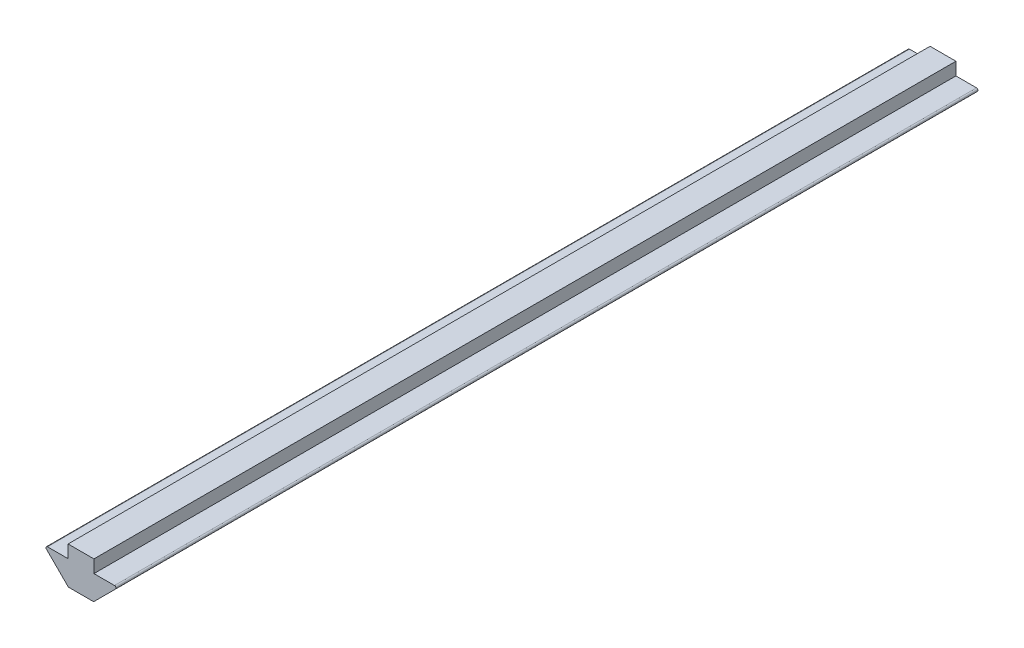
ISO-10303-21;
HEADER;
FILE_DESCRIPTION(('STEP AP214'),'2;1');
FILE_NAME('part.step','',(''),(''),'','','');
FILE_SCHEMA(('AUTOMOTIVE_DESIGN { 1 0 10303 214 1 1 1 1 }'));
ENDSEC;
DATA;
#1=APPLICATION_CONTEXT('core data for automotive mechanical design processes');
#2=APPLICATION_PROTOCOL_DEFINITION('international standard','automotive_design',2000,#1);
#3=PRODUCT_CONTEXT('',#1,'mechanical');
#4=PRODUCT('Part','Part','',(#3));
#5=PRODUCT_RELATED_PRODUCT_CATEGORY('part','',(#4));
#6=PRODUCT_DEFINITION_FORMATION('','',#4);
#7=PRODUCT_DEFINITION_CONTEXT('part definition',#1,'design');
#8=PRODUCT_DEFINITION('design','',#6,#7);
#9=PRODUCT_DEFINITION_SHAPE('','',#8);
#10=(LENGTH_UNIT() NAMED_UNIT(*) SI_UNIT(.MILLI.,.METRE.));
#11=(NAMED_UNIT(*) PLANE_ANGLE_UNIT() SI_UNIT($,.RADIAN.));
#12=(NAMED_UNIT(*) SI_UNIT($,.STERADIAN.) SOLID_ANGLE_UNIT());
#13=UNCERTAINTY_MEASURE_WITH_UNIT(LENGTH_MEASURE(1.E-05),#10,'distance_accuracy_value','');
#14=(GEOMETRIC_REPRESENTATION_CONTEXT(3) GLOBAL_UNCERTAINTY_ASSIGNED_CONTEXT((#13)) GLOBAL_UNIT_ASSIGNED_CONTEXT((#10,
#11,#12)) REPRESENTATION_CONTEXT('',''));
#15=CARTESIAN_POINT('',(0.,0.,0.));
#16=DIRECTION('',(0.,0.,1.));
#17=DIRECTION('',(1.,0.,0.));
#18=AXIS2_PLACEMENT_3D('',#15,#16,#17);
#19=CARTESIAN_POINT('',(-1.5993719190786E-13,8.73933982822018,-171.700000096));
#20=DIRECTION('',(0.,1.,0.));
#21=DIRECTION('',(-1.,0.,0.));
#22=AXIS2_PLACEMENT_3D('',#19,#20,#21);
#23=PLANE('',#22);
#24=DIRECTION('',(-1.,0.,0.));
#25=VECTOR('',#24,1.);
#26=CARTESIAN_POINT('',(-1.5993719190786E-13,8.73933982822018,-171.700000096));
#27=LINE('',#26,#25);
#28=CARTESIAN_POINT('',(6.67157287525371,8.7393398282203,-171.700000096));
#29=VERTEX_POINT('',#28);
#30=CARTESIAN_POINT('',(2.57499999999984,8.73933982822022,-171.700000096));
#31=VERTEX_POINT('',#30);
#32=EDGE_CURVE('E135',#29,#31,#27,.T.);
#33=ORIENTED_EDGE('',*,*,#32,.T.);
#34=DIRECTION('',(0.,0.,-1.));
#35=VECTOR('',#34,1.);
#36=CARTESIAN_POINT('',(2.57499999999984,8.73933982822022,0.));
#37=LINE('',#36,#35);
#38=CARTESIAN_POINT('',(2.57499999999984,8.73933982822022,0.));
#39=VERTEX_POINT('',#38);
#40=EDGE_CURVE('E183',#39,#31,#37,.T.);
#41=ORIENTED_EDGE('',*,*,#40,.F.);
#42=DIRECTION('',(-1.,0.,0.));
#43=VECTOR('',#42,1.);
#44=CARTESIAN_POINT('',(-1.5993719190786E-13,8.73933982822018,0.));
#45=LINE('',#44,#43);
#46=CARTESIAN_POINT('',(6.67157287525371,8.7393398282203,0.));
#47=VERTEX_POINT('',#46);
#48=EDGE_CURVE('E151',#47,#39,#45,.T.);
#49=ORIENTED_EDGE('',*,*,#48,.F.);
#50=DIRECTION('',(0.,0.,1.));
#51=VECTOR('',#50,1.);
#52=CARTESIAN_POINT('',(6.67157287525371,8.7393398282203,-171.700000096));
#53=LINE('',#52,#51);
#54=EDGE_CURVE('E161',#29,#47,#53,.T.);
#55=ORIENTED_EDGE('',*,*,#54,.F.);
#56=EDGE_LOOP('',(#33,#41,#49,#55));
#57=FACE_BOUND('',#56,.T.);
#58=ADVANCED_FACE('F41',(#57),#23,.T.);
#59=CARTESIAN_POINT('',(-0.671751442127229,0.67175144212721,-171.700000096));
#60=DIRECTION('',(0.707106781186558,-0.707106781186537,0.));
#61=DIRECTION('',(0.707106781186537,0.707106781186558,0.));
#62=AXIS2_PLACEMENT_3D('',#59,#60,#61);
#63=PLANE('',#62);
#64=DIRECTION('',(0.707106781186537,0.707106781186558,0.));
#65=VECTOR('',#64,1.);
#66=CARTESIAN_POINT('',(-0.671751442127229,0.67175144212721,0.));
#67=LINE('',#66,#65);
#68=CARTESIAN_POINT('',(2.51649711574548,3.86000000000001,0.));
#69=VERTEX_POINT('',#68);
#70=CARTESIAN_POINT('',(6.88370490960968,8.22720779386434,0.));
#71=VERTEX_POINT('',#70);
#72=EDGE_CURVE('E143',#69,#71,#67,.T.);
#73=ORIENTED_EDGE('',*,*,#72,.F.);
#74=DIRECTION('',(0.,0.,1.));
#75=VECTOR('',#74,1.);
#76=CARTESIAN_POINT('',(2.51649711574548,3.86000000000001,-171.700000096));
#77=LINE('',#76,#75);
#78=CARTESIAN_POINT('',(2.51649711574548,3.86000000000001,-171.700000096));
#79=VERTEX_POINT('',#78);
#80=EDGE_CURVE('E11',#79,#69,#77,.T.);
#81=ORIENTED_EDGE('',*,*,#80,.F.);
#82=DIRECTION('',(0.707106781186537,0.707106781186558,0.));
#83=VECTOR('',#82,1.);
#84=CARTESIAN_POINT('',(-0.671751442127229,0.67175144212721,-171.700000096));
#85=LINE('',#84,#83);
#86=CARTESIAN_POINT('',(6.88370490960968,8.22720779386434,-171.700000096));
#87=VERTEX_POINT('',#86);
#88=EDGE_CURVE('E158',#79,#87,#85,.T.);
#89=ORIENTED_EDGE('',*,*,#88,.T.);
#90=DIRECTION('',(0.,0.,1.));
#91=VECTOR('',#90,1.);
#92=CARTESIAN_POINT('',(6.88370490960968,8.22720779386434,-171.700000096));
#93=LINE('',#92,#91);
#94=EDGE_CURVE('E45',#87,#71,#93,.T.);
#95=ORIENTED_EDGE('',*,*,#94,.T.);
#96=EDGE_LOOP('',(#73,#81,#89,#95));
#97=FACE_BOUND('',#96,.T.);
#98=ADVANCED_FACE('F43',(#97),#63,.T.);
#99=CARTESIAN_POINT('',(0.,3.86,-171.700000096));
#100=DIRECTION('',(0.,1.,0.));
#101=DIRECTION('',(-1.,0.,0.));
#102=AXIS2_PLACEMENT_3D('',#99,#100,#101);
#103=PLANE('',#102);
#104=DIRECTION('',(-1.,0.,0.));
#105=VECTOR('',#104,1.);
#106=CARTESIAN_POINT('',(0.,3.86,0.));
#107=LINE('',#106,#105);
#108=CARTESIAN_POINT('',(-2.51649711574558,3.85999999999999,0.));
#109=VERTEX_POINT('',#108);
#110=EDGE_CURVE('E157',#69,#109,#107,.T.);
#111=ORIENTED_EDGE('',*,*,#110,.T.);
#112=DIRECTION('',(0.,0.,1.));
#113=VECTOR('',#112,1.);
#114=CARTESIAN_POINT('',(-2.51649711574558,3.85999999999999,-171.700000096));
#115=LINE('',#114,#113);
#116=CARTESIAN_POINT('',(-2.51649711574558,3.85999999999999,-171.700000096));
#117=VERTEX_POINT('',#116);
#118=EDGE_CURVE('E50',#117,#109,#115,.T.);
#119=ORIENTED_EDGE('',*,*,#118,.F.);
#120=DIRECTION('',(-1.,0.,0.));
#121=VECTOR('',#120,1.);
#122=CARTESIAN_POINT('',(0.,3.86,-171.700000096));
#123=LINE('',#122,#121);
#124=EDGE_CURVE('E117',#79,#117,#123,.T.);
#125=ORIENTED_EDGE('',*,*,#124,.F.);
#126=ORIENTED_EDGE('',*,*,#80,.T.);
#127=EDGE_LOOP('',(#111,#119,#125,#126));
#128=FACE_BOUND('',#127,.T.);
#129=ADVANCED_FACE('F166',(#128),#103,.F.);
#130=CARTESIAN_POINT('',(0.671751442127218,0.671751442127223,-171.700000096));
#131=DIRECTION('',(0.707106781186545,0.70710678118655,0.));
#132=DIRECTION('',(-0.70710678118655,0.707106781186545,0.));
#133=AXIS2_PLACEMENT_3D('',#130,#131,#132);
#134=PLANE('',#133);
#135=DIRECTION('',(-0.70710678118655,0.707106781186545,0.));
#136=VECTOR('',#135,1.);
#137=CARTESIAN_POINT('',(0.671751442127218,0.671751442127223,0.));
#138=LINE('',#137,#136);
#139=CARTESIAN_POINT('',(-6.88370490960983,8.22720779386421,0.));
#140=VERTEX_POINT('',#139);
#141=EDGE_CURVE('E126',#109,#140,#138,.T.);
#142=ORIENTED_EDGE('',*,*,#141,.T.);
#143=DIRECTION('',(0.,0.,1.));
#144=VECTOR('',#143,1.);
#145=CARTESIAN_POINT('',(-6.88370490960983,8.22720779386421,-171.700000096));
#146=LINE('',#145,#144);
#147=CARTESIAN_POINT('',(-6.88370490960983,8.22720779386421,-171.700000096));
#148=VERTEX_POINT('',#147);
#149=EDGE_CURVE('E123',#148,#140,#146,.T.);
#150=ORIENTED_EDGE('',*,*,#149,.F.);
#151=DIRECTION('',(-0.70710678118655,0.707106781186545,0.));
#152=VECTOR('',#151,1.);
#153=CARTESIAN_POINT('',(0.671751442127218,0.671751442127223,-171.700000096));
#154=LINE('',#153,#152);
#155=EDGE_CURVE('E110',#117,#148,#154,.T.);
#156=ORIENTED_EDGE('',*,*,#155,.F.);
#157=ORIENTED_EDGE('',*,*,#118,.T.);
#158=EDGE_LOOP('',(#142,#150,#156,#157));
#159=FACE_BOUND('',#158,.T.);
#160=ADVANCED_FACE('F124',(#159),#134,.F.);
#161=CARTESIAN_POINT('',(-6.67157287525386,8.43933982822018,-171.700000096));
#162=DIRECTION('',(0.,0.,1.));
#163=DIRECTION('',(1.,0.,0.));
#164=AXIS2_PLACEMENT_3D('',#161,#162,#163);
#165=CYLINDRICAL_SURFACE('',#164,0.300000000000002);
#166=CARTESIAN_POINT('',(-6.67157287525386,8.43933982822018,0.));
#167=DIRECTION('',(0.,0.,1.));
#168=DIRECTION('',(1.,0.,0.));
#169=AXIS2_PLACEMENT_3D('',#166,#167,#168);
#170=CIRCLE('',#169,0.300000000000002);
#171=CARTESIAN_POINT('',(-6.67157287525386,8.73933982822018,0.));
#172=VERTEX_POINT('',#171);
#173=EDGE_CURVE('E154',#172,#140,#170,.T.);
#174=ORIENTED_EDGE('',*,*,#173,.F.);
#175=DIRECTION('',(0.,0.,1.));
#176=VECTOR('',#175,1.);
#177=CARTESIAN_POINT('',(-6.67157287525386,8.73933982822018,-171.700000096));
#178=LINE('',#177,#176);
#179=CARTESIAN_POINT('',(-6.67157287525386,8.73933982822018,-171.700000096));
#180=VERTEX_POINT('',#179);
#181=EDGE_CURVE('E130',#180,#172,#178,.T.);
#182=ORIENTED_EDGE('',*,*,#181,.F.);
#183=CARTESIAN_POINT('',(-6.67157287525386,8.43933982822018,-171.700000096));
#184=DIRECTION('',(0.,0.,1.));
#185=DIRECTION('',(1.,0.,0.));
#186=AXIS2_PLACEMENT_3D('',#183,#184,#185);
#187=CIRCLE('',#186,0.300000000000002);
#188=EDGE_CURVE('E116',#180,#148,#187,.T.);
#189=ORIENTED_EDGE('',*,*,#188,.T.);
#190=ORIENTED_EDGE('',*,*,#149,.T.);
#191=EDGE_LOOP('',(#174,#182,#189,#190));
#192=FACE_BOUND('',#191,.T.);
#193=ADVANCED_FACE('F133',(#192),#165,.T.);
#194=DIRECTION('',(0.,0.,-1.));
#195=VECTOR('',#194,1.);
#196=CARTESIAN_POINT('',(-2.57500000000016,8.73933982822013,0.));
#197=LINE('',#196,#195);
#198=CARTESIAN_POINT('',(-2.57500000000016,8.73933982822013,0.));
#199=VERTEX_POINT('',#198);
#200=CARTESIAN_POINT('',(-2.57500000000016,8.73933982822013,-171.700000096));
#201=VERTEX_POINT('',#200);
#202=EDGE_CURVE('E58',#199,#201,#197,.T.);
#203=ORIENTED_EDGE('',*,*,#202,.T.);
#204=EDGE_CURVE('E138',#201,#180,#27,.T.);
#205=ORIENTED_EDGE('',*,*,#204,.T.);
#206=ORIENTED_EDGE('',*,*,#181,.T.);
#207=EDGE_CURVE('E150',#199,#172,#45,.T.);
#208=ORIENTED_EDGE('',*,*,#207,.F.);
#209=EDGE_LOOP('',(#203,#205,#206,#208));
#210=FACE_BOUND('',#209,.T.);
#211=ADVANCED_FACE('F221',(#210),#23,.T.);
#212=CARTESIAN_POINT('',(6.67157287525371,8.4393398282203,-171.700000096));
#213=DIRECTION('',(0.,0.,1.));
#214=DIRECTION('',(1.,0.,0.));
#215=AXIS2_PLACEMENT_3D('',#212,#213,#214);
#216=CYLINDRICAL_SURFACE('',#215,0.300000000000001);
#217=CARTESIAN_POINT('',(6.67157287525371,8.4393398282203,0.));
#218=DIRECTION('',(0.,0.,1.));
#219=DIRECTION('',(1.,0.,0.));
#220=AXIS2_PLACEMENT_3D('',#217,#218,#219);
#221=CIRCLE('',#220,0.300000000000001);
#222=EDGE_CURVE('E146',#71,#47,#221,.T.);
#223=ORIENTED_EDGE('',*,*,#222,.F.);
#224=ORIENTED_EDGE('',*,*,#94,.F.);
#225=CARTESIAN_POINT('',(6.67157287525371,8.4393398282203,-171.700000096));
#226=DIRECTION('',(0.,0.,1.));
#227=DIRECTION('',(1.,0.,0.));
#228=AXIS2_PLACEMENT_3D('',#225,#226,#227);
#229=CIRCLE('',#228,0.300000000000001);
#230=EDGE_CURVE('E168',#87,#29,#229,.T.);
#231=ORIENTED_EDGE('',*,*,#230,.T.);
#232=ORIENTED_EDGE('',*,*,#54,.T.);
#233=EDGE_LOOP('',(#223,#224,#231,#232));
#234=FACE_BOUND('',#233,.T.);
#235=ADVANCED_FACE('F163',(#234),#216,.T.);
#236=CARTESIAN_POINT('',(0.,0.,-171.700000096));
#237=DIRECTION('',(0.,0.,1.));
#238=DIRECTION('',(1.,0.,0.));
#239=AXIS2_PLACEMENT_3D('',#236,#237,#238);
#240=PLANE('',#239);
#241=ORIENTED_EDGE('',*,*,#88,.F.);
#242=ORIENTED_EDGE('',*,*,#124,.T.);
#243=ORIENTED_EDGE('',*,*,#155,.T.);
#244=ORIENTED_EDGE('',*,*,#188,.F.);
#245=ORIENTED_EDGE('',*,*,#204,.F.);
#246=DIRECTION('',(0.,-1.,0.));
#247=VECTOR('',#246,1.);
#248=CARTESIAN_POINT('',(-2.57500000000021,11.2793398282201,-171.700000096));
#249=LINE('',#248,#247);
#250=CARTESIAN_POINT('',(-2.57500000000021,11.2793398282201,-171.700000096));
#251=VERTEX_POINT('',#250);
#252=EDGE_CURVE('E176',#251,#201,#249,.T.);
#253=ORIENTED_EDGE('',*,*,#252,.F.);
#254=DIRECTION('',(-1.,0.,0.));
#255=VECTOR('',#254,1.);
#256=CARTESIAN_POINT('',(-2.06458936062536E-13,11.2793398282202,-171.700000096));
#257=LINE('',#256,#255);
#258=CARTESIAN_POINT('',(2.57499999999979,11.2793398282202,-171.700000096));
#259=VERTEX_POINT('',#258);
#260=EDGE_CURVE('E188',#259,#251,#257,.T.);
#261=ORIENTED_EDGE('',*,*,#260,.F.);
#262=DIRECTION('',(0.,-1.,0.));
#263=VECTOR('',#262,1.);
#264=CARTESIAN_POINT('',(2.57499999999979,11.2793398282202,-171.700000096));
#265=LINE('',#264,#263);
#266=EDGE_CURVE('E173',#259,#31,#265,.T.);
#267=ORIENTED_EDGE('',*,*,#266,.T.);
#268=ORIENTED_EDGE('',*,*,#32,.F.);
#269=ORIENTED_EDGE('',*,*,#230,.F.);
#270=EDGE_LOOP('',(#241,#242,#243,#244,#245,#253,#261,#267,#268,#269));
#271=FACE_BOUND('',#270,.T.);
#272=ADVANCED_FACE('F113',(#271),#240,.F.);
#273=CARTESIAN_POINT('',(0.,0.,0.));
#274=DIRECTION('',(0.,0.,1.));
#275=DIRECTION('',(1.,0.,0.));
#276=AXIS2_PLACEMENT_3D('',#273,#274,#275);
#277=PLANE('',#276);
#278=ORIENTED_EDGE('',*,*,#72,.T.);
#279=ORIENTED_EDGE('',*,*,#222,.T.);
#280=ORIENTED_EDGE('',*,*,#48,.T.);
#281=DIRECTION('',(0.,-1.,0.));
#282=VECTOR('',#281,1.);
#283=CARTESIAN_POINT('',(2.57499999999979,11.2793398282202,0.));
#284=LINE('',#283,#282);
#285=CARTESIAN_POINT('',(2.57499999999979,11.2793398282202,0.));
#286=VERTEX_POINT('',#285);
#287=EDGE_CURVE('E147',#286,#39,#284,.T.);
#288=ORIENTED_EDGE('',*,*,#287,.F.);
#289=DIRECTION('',(1.,0.,0.));
#290=VECTOR('',#289,1.);
#291=CARTESIAN_POINT('',(-2.06458936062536E-13,11.2793398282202,0.));
#292=LINE('',#291,#290);
#293=CARTESIAN_POINT('',(-2.57500000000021,11.2793398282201,0.));
#294=VERTEX_POINT('',#293);
#295=EDGE_CURVE('E182',#294,#286,#292,.T.);
#296=ORIENTED_EDGE('',*,*,#295,.F.);
#297=DIRECTION('',(0.,-1.,0.));
#298=VECTOR('',#297,1.);
#299=CARTESIAN_POINT('',(-2.57500000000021,11.2793398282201,0.));
#300=LINE('',#299,#298);
#301=EDGE_CURVE('E178',#294,#199,#300,.T.);
#302=ORIENTED_EDGE('',*,*,#301,.T.);
#303=ORIENTED_EDGE('',*,*,#207,.T.);
#304=ORIENTED_EDGE('',*,*,#173,.T.);
#305=ORIENTED_EDGE('',*,*,#141,.F.);
#306=ORIENTED_EDGE('',*,*,#110,.F.);
#307=EDGE_LOOP('',(#278,#279,#280,#288,#296,#302,#303,#304,#305,#306));
#308=FACE_BOUND('',#307,.T.);
#309=ADVANCED_FACE('F165',(#308),#277,.T.);
#310=CARTESIAN_POINT('',(2.57499999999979,11.2793398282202,0.));
#311=DIRECTION('',(-1.,0.,0.));
#312=DIRECTION('',(0.,-1.,0.));
#313=AXIS2_PLACEMENT_3D('',#310,#311,#312);
#314=PLANE('',#313);
#315=ORIENTED_EDGE('',*,*,#40,.T.);
#316=ORIENTED_EDGE('',*,*,#266,.F.);
#317=DIRECTION('',(0.,0.,-1.));
#318=VECTOR('',#317,1.);
#319=CARTESIAN_POINT('',(2.57499999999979,11.2793398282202,0.));
#320=LINE('',#319,#318);
#321=EDGE_CURVE('E191',#286,#259,#320,.T.);
#322=ORIENTED_EDGE('',*,*,#321,.F.);
#323=ORIENTED_EDGE('',*,*,#287,.T.);
#324=EDGE_LOOP('',(#315,#316,#322,#323));
#325=FACE_BOUND('',#324,.T.);
#326=ADVANCED_FACE('F208',(#325),#314,.F.);
#327=CARTESIAN_POINT('',(-2.57500000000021,11.2793398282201,0.));
#328=DIRECTION('',(-1.,0.,0.));
#329=DIRECTION('',(0.,-1.,0.));
#330=AXIS2_PLACEMENT_3D('',#327,#328,#329);
#331=PLANE('',#330);
#332=ORIENTED_EDGE('',*,*,#202,.F.);
#333=ORIENTED_EDGE('',*,*,#301,.F.);
#334=DIRECTION('',(0.,0.,-1.));
#335=VECTOR('',#334,1.);
#336=CARTESIAN_POINT('',(-2.57500000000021,11.2793398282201,0.));
#337=LINE('',#336,#335);
#338=EDGE_CURVE('E180',#294,#251,#337,.T.);
#339=ORIENTED_EDGE('',*,*,#338,.T.);
#340=ORIENTED_EDGE('',*,*,#252,.T.);
#341=EDGE_LOOP('',(#332,#333,#339,#340));
#342=FACE_BOUND('',#341,.T.);
#343=ADVANCED_FACE('F218',(#342),#331,.T.);
#344=CARTESIAN_POINT('',(-2.06458936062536E-13,11.2793398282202,0.));
#345=DIRECTION('',(0.,1.,0.));
#346=DIRECTION('',(-1.,0.,0.));
#347=AXIS2_PLACEMENT_3D('',#344,#345,#346);
#348=PLANE('',#347);
#349=ORIENTED_EDGE('',*,*,#295,.T.);
#350=ORIENTED_EDGE('',*,*,#321,.T.);
#351=ORIENTED_EDGE('',*,*,#260,.T.);
#352=ORIENTED_EDGE('',*,*,#338,.F.);
#353=EDGE_LOOP('',(#349,#350,#351,#352));
#354=FACE_BOUND('',#353,.T.);
#355=ADVANCED_FACE('F200',(#354),#348,.T.);
#356=CLOSED_SHELL('',(#58,#98,#129,#160,#193,#211,#235,#272,#309,#326,#343,#355));
#357=MANIFOLD_SOLID_BREP('B2',#356);
#358=ADVANCED_BREP_SHAPE_REPRESENTATION('',(#18,#357),#14);
#359=SHAPE_DEFINITION_REPRESENTATION(#9,#358);
ENDSEC;
END-ISO-10303-21;
